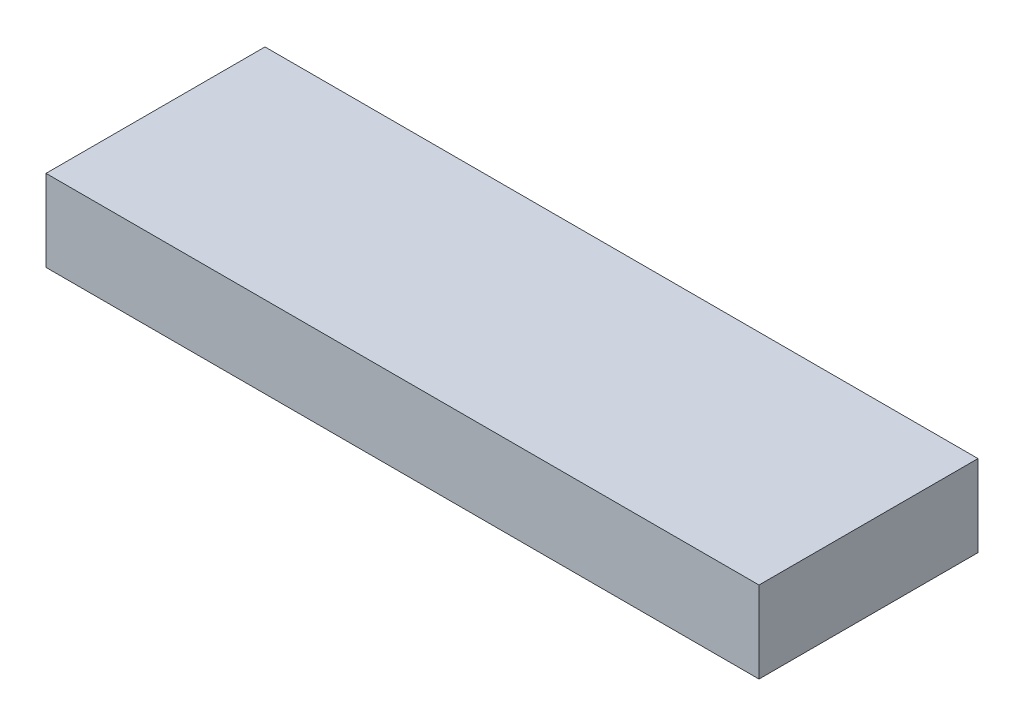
from build123d import *

# Parameters (mm, degrees)
SKETCH1_W           = 140
SKETCH1_H           = 43
BOSS_EXTRUDE1_DEPTH = 8


with BuildPart() as part:
    # Sketch1 → Boss-Extrude1 (new, symmetric)
    with BuildSketch(Plane(origin=(0, 0, 0), x_dir=(1, 0, 0), z_dir=(0, 1, 0))):
        Rectangle(SKETCH1_W, SKETCH1_H)
    extrude(amount=BOSS_EXTRUDE1_DEPTH, both=True)


solid = part.part
